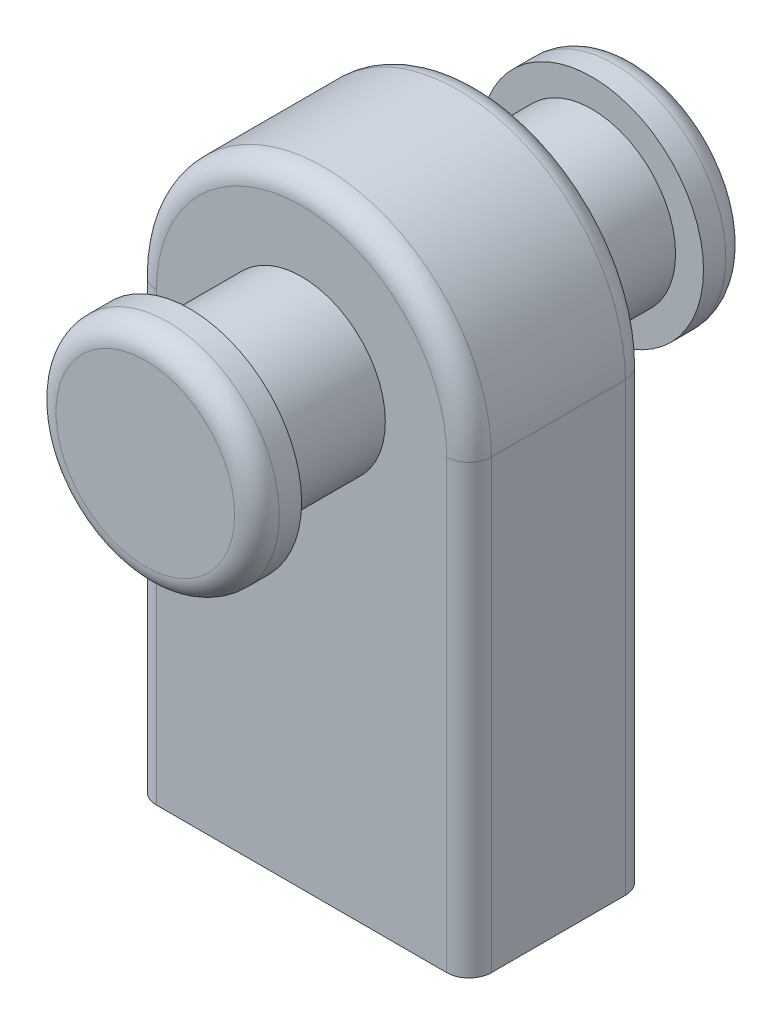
from build123d import *

# Parameters (mm, degrees)
SKETCH1_W           = 508
SKETCH1_H           = 25.4
BOSS_EXTRUDE1_DEPTH = 254
BOSS_EXTRUDE2_DEPTH = 10.16
SKETCH1_4_R         = 9.525
BOSS_EXTRUDE3_DEPTH = 22.86
SKETCH2_R           = 12.7
BOSS_EXTRUDE4_DEPTH = 5.08
FILLET1_R           = 2.54
SKETCH3_W           = 508
SKETCH3_H           = 508
CUT_EXTRUDE1_DEPTH  = 25.4


with BuildPart() as part:
    # Sketch1 → Boss-Extrude1 (new, symmetric)
    with BuildSketch(Plane.XY):
        with Locations((0, -63.5)):
            Rectangle(SKETCH1_W, SKETCH1_H)
    extrude(amount=BOSS_EXTRUDE1_DEPTH, both=True)

    # Sketch1_3 → Boss-Extrude2 (add, symmetric)
    with BuildSketch(Plane.XY):
        with BuildLine():
            ThreePointArc((19.05, 0), (0, 19.05), (-19.05, 0))
            Line((-19.05, 0), (-19.05, -50.8))
            Line((-19.05, -50.8), (19.05, -50.8))
            Line((19.05, -50.8), (19.05, 0))
        make_face()
    extrude(amount=BOSS_EXTRUDE2_DEPTH, both=True)

    # Sketch1_4 → Boss-Extrude3 (add, symmetric)
    with BuildSketch(Plane.XY):
        Circle(SKETCH1_4_R)
    extrude(amount=BOSS_EXTRUDE3_DEPTH, both=True)

    # Sketch2 → Boss-Extrude4 (add)
    with BuildSketch(Plane.XY.offset(22.86)):
        Circle(SKETCH2_R)
    boss_extrude4 = extrude(amount=BOSS_EXTRUDE4_DEPTH)

    # Mirror1: Boss-Extrude4 across plane
    add(boss_extrude4.mirror(Plane.XY))

    # Fillet1
    fillet1_edges = [part.edges().sort_by_distance(p)[0] for p in [
        (0, 19.05, -10.16),
        (-19.05, -25.4, -10.16),
        (19.05, -25.4, 10.16),
        (0, 19.05, 10.16),
        (-19.05, -25.4, 10.16),
        (19.05, -25.4, -10.16),
        (-12.7, 0, 27.94),
        (-12.7, 0, -27.94),
    ]]
    fillet(fillet1_edges, radius=FILLET1_R)

    # Sketch3 → Cut-Extrude1 (cut)
    with BuildSketch(Plane.XZ.offset(76.2)):
        Rectangle(SKETCH3_W, SKETCH3_H)
    extrude(amount=-CUT_EXTRUDE1_DEPTH, mode=Mode.SUBTRACT)


solid = part.part
